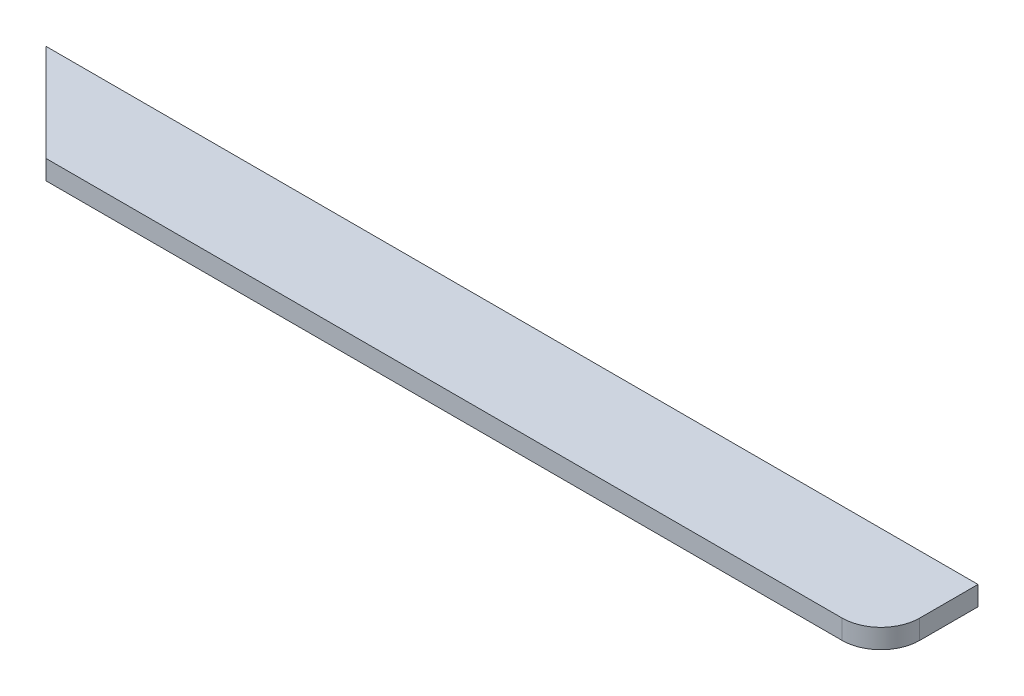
ISO-10303-21;
HEADER;
FILE_DESCRIPTION(('STEP AP214'),'2;1');
FILE_NAME('part.step','',(''),(''),'','','');
FILE_SCHEMA(('AUTOMOTIVE_DESIGN { 1 0 10303 214 1 1 1 1 }'));
ENDSEC;
DATA;
#1=APPLICATION_CONTEXT('core data for automotive mechanical design processes');
#2=APPLICATION_PROTOCOL_DEFINITION('international standard','automotive_design',2000,#1);
#3=PRODUCT_CONTEXT('',#1,'mechanical');
#4=PRODUCT('Part','Part','',(#3));
#5=PRODUCT_RELATED_PRODUCT_CATEGORY('part','',(#4));
#6=PRODUCT_DEFINITION_FORMATION('','',#4);
#7=PRODUCT_DEFINITION_CONTEXT('part definition',#1,'design');
#8=PRODUCT_DEFINITION('design','',#6,#7);
#9=PRODUCT_DEFINITION_SHAPE('','',#8);
#10=(LENGTH_UNIT() NAMED_UNIT(*) SI_UNIT(.MILLI.,.METRE.));
#11=(NAMED_UNIT(*) PLANE_ANGLE_UNIT() SI_UNIT($,.RADIAN.));
#12=(NAMED_UNIT(*) SI_UNIT($,.STERADIAN.) SOLID_ANGLE_UNIT());
#13=UNCERTAINTY_MEASURE_WITH_UNIT(LENGTH_MEASURE(1.E-05),#10,'distance_accuracy_value','');
#14=(GEOMETRIC_REPRESENTATION_CONTEXT(3) GLOBAL_UNCERTAINTY_ASSIGNED_CONTEXT((#13)) GLOBAL_UNIT_ASSIGNED_CONTEXT((#10,
#11,#12)) REPRESENTATION_CONTEXT('',''));
#15=CARTESIAN_POINT('',(0.,0.,0.));
#16=DIRECTION('',(0.,0.,1.));
#17=DIRECTION('',(1.,0.,0.));
#18=AXIS2_PLACEMENT_3D('',#15,#16,#17);
#19=CARTESIAN_POINT('',(0.,857.25,-1219.2));
#20=DIRECTION('',(0.,0.,1.));
#21=DIRECTION('',(1.,0.,0.));
#22=AXIS2_PLACEMENT_3D('',#19,#20,#21);
#23=PLANE('',#22);
#24=DIRECTION('',(-1.,0.,0.));
#25=VECTOR('',#24,1.);
#26=CARTESIAN_POINT('',(0.,831.85,-1219.2));
#27=LINE('',#26,#25);
#28=CARTESIAN_POINT('',(1219.2,831.85,-1219.2));
#29=VERTEX_POINT('',#28);
#30=CARTESIAN_POINT('',(0.,831.85,-1219.2));
#31=VERTEX_POINT('',#30);
#32=EDGE_CURVE('E106',#29,#31,#27,.T.);
#33=ORIENTED_EDGE('',*,*,#32,.T.);
#34=DIRECTION('',(0.,-1.,0.));
#35=VECTOR('',#34,1.);
#36=CARTESIAN_POINT('',(0.,857.25,-1219.2));
#37=LINE('',#36,#35);
#38=CARTESIAN_POINT('',(0.,857.25,-1219.2));
#39=VERTEX_POINT('',#38);
#40=EDGE_CURVE('E11',#39,#31,#37,.T.);
#41=ORIENTED_EDGE('',*,*,#40,.F.);
#42=DIRECTION('',(-1.,0.,0.));
#43=VECTOR('',#42,1.);
#44=CARTESIAN_POINT('',(0.,857.25,-1219.2));
#45=LINE('',#44,#43);
#46=CARTESIAN_POINT('',(1219.2,857.25,-1219.2));
#47=VERTEX_POINT('',#46);
#48=EDGE_CURVE('E114',#47,#39,#45,.T.);
#49=ORIENTED_EDGE('',*,*,#48,.F.);
#50=DIRECTION('',(0.,-1.,0.));
#51=VECTOR('',#50,1.);
#52=CARTESIAN_POINT('',(1219.2,857.25,-1219.2));
#53=LINE('',#52,#51);
#54=EDGE_CURVE('E102',#47,#29,#53,.T.);
#55=ORIENTED_EDGE('',*,*,#54,.T.);
#56=EDGE_LOOP('',(#33,#41,#49,#55));
#57=FACE_BOUND('',#56,.T.);
#58=ADVANCED_FACE('F32',(#57),#23,.F.);
#59=CARTESIAN_POINT('',(0.,857.25,-1219.2));
#60=DIRECTION('',(0.707106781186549,0.,-0.707106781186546));
#61=DIRECTION('',(-0.707106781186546,0.,-0.707106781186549));
#62=AXIS2_PLACEMENT_3D('',#59,#60,#61);
#63=PLANE('',#62);
#64=DIRECTION('',(0.707106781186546,0.,0.707106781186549));
#65=VECTOR('',#64,1.);
#66=CARTESIAN_POINT('',(0.,831.85,-1219.2));
#67=LINE('',#66,#65);
#68=CARTESIAN_POINT('',(127.,831.85,-1092.2));
#69=VERTEX_POINT('',#68);
#70=EDGE_CURVE('E109',#31,#69,#67,.T.);
#71=ORIENTED_EDGE('',*,*,#70,.T.);
#72=DIRECTION('',(0.,-1.,0.));
#73=VECTOR('',#72,1.);
#74=CARTESIAN_POINT('',(127.,857.25,-1092.2));
#75=LINE('',#74,#73);
#76=CARTESIAN_POINT('',(127.,857.25,-1092.2));
#77=VERTEX_POINT('',#76);
#78=EDGE_CURVE('E40',#77,#69,#75,.T.);
#79=ORIENTED_EDGE('',*,*,#78,.F.);
#80=DIRECTION('',(0.707106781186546,0.,0.707106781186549));
#81=VECTOR('',#80,1.);
#82=CARTESIAN_POINT('',(0.,857.25,-1219.2));
#83=LINE('',#82,#81);
#84=EDGE_CURVE('E82',#39,#77,#83,.T.);
#85=ORIENTED_EDGE('',*,*,#84,.F.);
#86=ORIENTED_EDGE('',*,*,#40,.T.);
#87=EDGE_LOOP('',(#71,#79,#85,#86));
#88=FACE_BOUND('',#87,.T.);
#89=ADVANCED_FACE('F133',(#88),#63,.F.);
#90=CARTESIAN_POINT('',(127.,857.25,-1092.2));
#91=DIRECTION('',(0.,0.,-1.));
#92=DIRECTION('',(-1.,0.,0.));
#93=AXIS2_PLACEMENT_3D('',#90,#91,#92);
#94=PLANE('',#93);
#95=DIRECTION('',(1.,0.,0.));
#96=VECTOR('',#95,1.);
#97=CARTESIAN_POINT('',(127.,831.85,-1092.2));
#98=LINE('',#97,#96);
#99=CARTESIAN_POINT('',(1168.4,831.85,-1092.2));
#100=VERTEX_POINT('',#99);
#101=EDGE_CURVE('E97',#69,#100,#98,.T.);
#102=ORIENTED_EDGE('',*,*,#101,.T.);
#103=DIRECTION('',(0.,-1.,0.));
#104=VECTOR('',#103,1.);
#105=CARTESIAN_POINT('',(1168.4,857.25,-1092.2));
#106=LINE('',#105,#104);
#107=CARTESIAN_POINT('',(1168.4,857.25,-1092.2));
#108=VERTEX_POINT('',#107);
#109=EDGE_CURVE('E94',#108,#100,#106,.T.);
#110=ORIENTED_EDGE('',*,*,#109,.F.);
#111=DIRECTION('',(1.,0.,0.));
#112=VECTOR('',#111,1.);
#113=CARTESIAN_POINT('',(127.,857.25,-1092.2));
#114=LINE('',#113,#112);
#115=EDGE_CURVE('E86',#77,#108,#114,.T.);
#116=ORIENTED_EDGE('',*,*,#115,.F.);
#117=ORIENTED_EDGE('',*,*,#78,.T.);
#118=EDGE_LOOP('',(#102,#110,#116,#117));
#119=FACE_BOUND('',#118,.T.);
#120=ADVANCED_FACE('F95',(#119),#94,.F.);
#121=CARTESIAN_POINT('',(1168.4,857.25,-1143.));
#122=DIRECTION('',(0.,-1.,0.));
#123=DIRECTION('',(0.,0.,-1.));
#124=AXIS2_PLACEMENT_3D('',#121,#122,#123);
#125=CYLINDRICAL_SURFACE('',#124,50.8);
#126=CARTESIAN_POINT('',(1168.4,831.85,-1143.));
#127=DIRECTION('',(0.,1.,0.));
#128=DIRECTION('',(0.,0.,1.));
#129=AXIS2_PLACEMENT_3D('',#126,#127,#128);
#130=CIRCLE('',#129,50.8);
#131=CARTESIAN_POINT('',(1219.2,831.85,-1143.));
#132=VERTEX_POINT('',#131);
#133=EDGE_CURVE('E68',#100,#132,#130,.T.);
#134=ORIENTED_EDGE('',*,*,#133,.T.);
#135=DIRECTION('',(0.,-1.,0.));
#136=VECTOR('',#135,1.);
#137=CARTESIAN_POINT('',(1219.2,857.25,-1143.));
#138=LINE('',#137,#136);
#139=CARTESIAN_POINT('',(1219.2,857.25,-1143.));
#140=VERTEX_POINT('',#139);
#141=EDGE_CURVE('E98',#140,#132,#138,.T.);
#142=ORIENTED_EDGE('',*,*,#141,.F.);
#143=CARTESIAN_POINT('',(1168.4,857.25,-1143.));
#144=DIRECTION('',(0.,1.,0.));
#145=DIRECTION('',(0.,0.,1.));
#146=AXIS2_PLACEMENT_3D('',#143,#144,#145);
#147=CIRCLE('',#146,50.8);
#148=EDGE_CURVE('E90',#108,#140,#147,.T.);
#149=ORIENTED_EDGE('',*,*,#148,.F.);
#150=ORIENTED_EDGE('',*,*,#109,.T.);
#151=EDGE_LOOP('',(#134,#142,#149,#150));
#152=FACE_BOUND('',#151,.T.);
#153=ADVANCED_FACE('F100',(#152),#125,.T.);
#154=CARTESIAN_POINT('',(1219.2,857.25,-1143.));
#155=DIRECTION('',(-1.,0.,0.));
#156=DIRECTION('',(0.,0.,1.));
#157=AXIS2_PLACEMENT_3D('',#154,#155,#156);
#158=PLANE('',#157);
#159=DIRECTION('',(0.,0.,-1.));
#160=VECTOR('',#159,1.);
#161=CARTESIAN_POINT('',(1219.2,831.85,-1143.));
#162=LINE('',#161,#160);
#163=EDGE_CURVE('E74',#132,#29,#162,.T.);
#164=ORIENTED_EDGE('',*,*,#163,.T.);
#165=ORIENTED_EDGE('',*,*,#54,.F.);
#166=DIRECTION('',(0.,0.,-1.));
#167=VECTOR('',#166,1.);
#168=CARTESIAN_POINT('',(1219.2,857.25,-1143.));
#169=LINE('',#168,#167);
#170=EDGE_CURVE('E48',#140,#47,#169,.T.);
#171=ORIENTED_EDGE('',*,*,#170,.F.);
#172=ORIENTED_EDGE('',*,*,#141,.T.);
#173=EDGE_LOOP('',(#164,#165,#171,#172));
#174=FACE_BOUND('',#173,.T.);
#175=ADVANCED_FACE('F122',(#174),#158,.F.);
#176=CARTESIAN_POINT('',(1168.4,857.25,-1143.));
#177=DIRECTION('',(0.,1.,0.));
#178=DIRECTION('',(0.,0.,1.));
#179=AXIS2_PLACEMENT_3D('',#176,#177,#178);
#180=PLANE('',#179);
#181=ORIENTED_EDGE('',*,*,#48,.T.);
#182=ORIENTED_EDGE('',*,*,#84,.T.);
#183=ORIENTED_EDGE('',*,*,#115,.T.);
#184=ORIENTED_EDGE('',*,*,#148,.T.);
#185=ORIENTED_EDGE('',*,*,#170,.T.);
#186=EDGE_LOOP('',(#181,#182,#183,#184,#185));
#187=FACE_BOUND('',#186,.T.);
#188=ADVANCED_FACE('F88',(#187),#180,.T.);
#189=CARTESIAN_POINT('',(1168.4,831.85,-1143.));
#190=DIRECTION('',(0.,1.,0.));
#191=DIRECTION('',(0.,0.,1.));
#192=AXIS2_PLACEMENT_3D('',#189,#190,#191);
#193=PLANE('',#192);
#194=ORIENTED_EDGE('',*,*,#32,.F.);
#195=ORIENTED_EDGE('',*,*,#163,.F.);
#196=ORIENTED_EDGE('',*,*,#133,.F.);
#197=ORIENTED_EDGE('',*,*,#101,.F.);
#198=ORIENTED_EDGE('',*,*,#70,.F.);
#199=EDGE_LOOP('',(#194,#195,#196,#197,#198));
#200=FACE_BOUND('',#199,.T.);
#201=ADVANCED_FACE('F118',(#200),#193,.F.);
#202=CLOSED_SHELL('',(#58,#89,#120,#153,#175,#188,#201));
#203=MANIFOLD_SOLID_BREP('B2',#202);
#204=ADVANCED_BREP_SHAPE_REPRESENTATION('',(#18,#203),#14);
#205=SHAPE_DEFINITION_REPRESENTATION(#9,#204);
ENDSEC;
END-ISO-10303-21;
